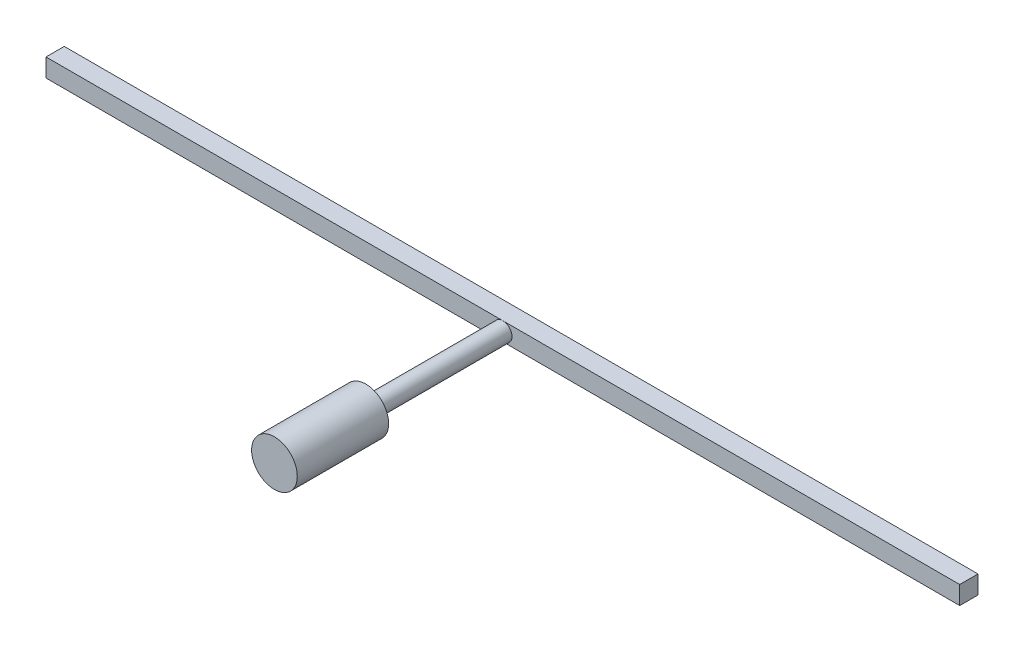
from build123d import *

# Parameters (mm, degrees)
ESQUISSE1_R          = 5
BASE_EXTRUSION_DEPTH = 10
ESQUISSE2_R          = 2
BOSS_EXTRU_1_DEPTH   = 30
ESQUISSE3_W          = 200
ESQUISSE3_H          = 4
BOSS_EXTRU_2_DEPTH   = 4


with BuildPart() as part:
    # Esquisse1 → Base-Extrusion (new, symmetric)
    with BuildSketch(Plane.XY):
        Circle(ESQUISSE1_R)
    extrude(amount=BASE_EXTRUSION_DEPTH, both=True)

    # Esquisse2 → Boss.-Extru.1 (add)
    with BuildSketch(Plane(origin=(0, 0, -10), x_dir=(-1, 0, 0), z_dir=(0, 0, -1))):
        with Locations(Location((0, 0, 0), (0, 0, 180))):
            Circle(ESQUISSE2_R)
    extrude(amount=BOSS_EXTRU_1_DEPTH)

    # Esquisse3 → Boss.-Extru.2 (add)
    with BuildSketch(Plane(origin=(0, 0, -40), x_dir=(-1, 0, 0), z_dir=(0, 0, -1))):
        Rectangle(ESQUISSE3_W, ESQUISSE3_H)
    extrude(amount=BOSS_EXTRU_2_DEPTH)


solid = part.part
